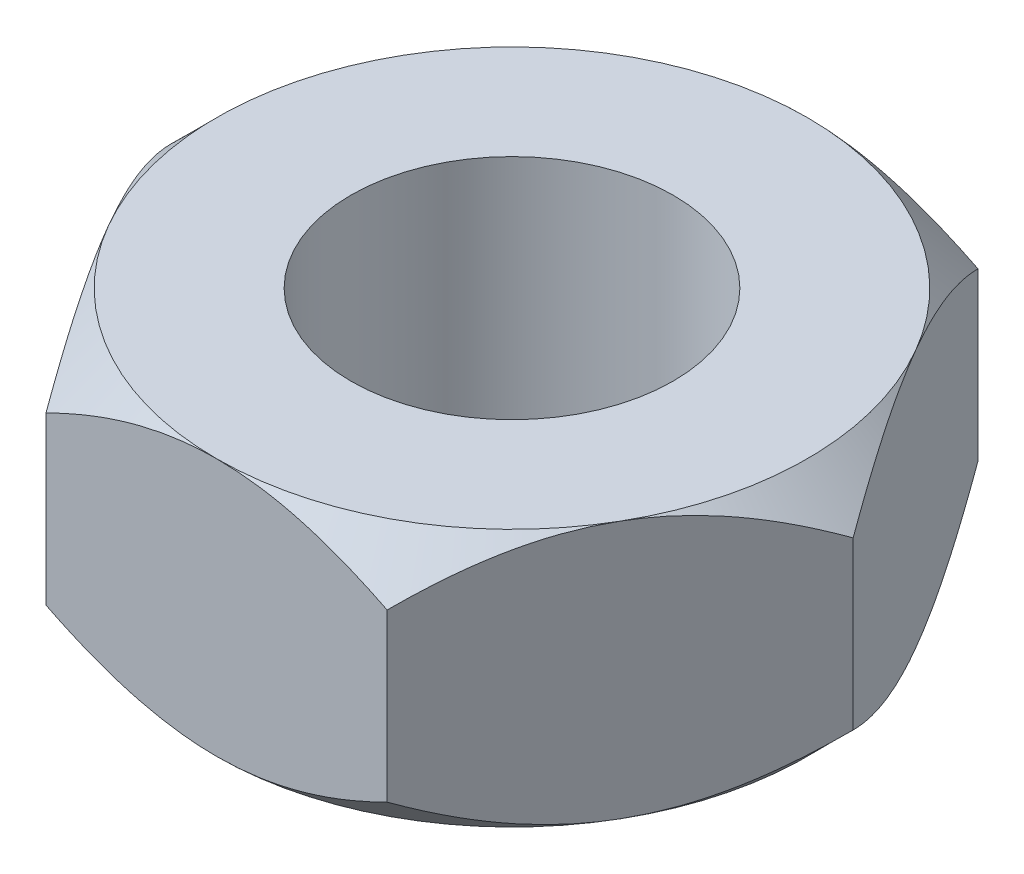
ISO-10303-21;
HEADER;
FILE_DESCRIPTION(('STEP AP214'),'2;1');
FILE_NAME('part.step','',(''),(''),'','','');
FILE_SCHEMA(('AUTOMOTIVE_DESIGN { 1 0 10303 214 1 1 1 1 }'));
ENDSEC;
DATA;
#1=APPLICATION_CONTEXT('core data for automotive mechanical design processes');
#2=APPLICATION_PROTOCOL_DEFINITION('international standard','automotive_design',2000,#1);
#3=PRODUCT_CONTEXT('',#1,'mechanical');
#4=PRODUCT('Part','Part','',(#3));
#5=PRODUCT_RELATED_PRODUCT_CATEGORY('part','',(#4));
#6=PRODUCT_DEFINITION_FORMATION('','',#4);
#7=PRODUCT_DEFINITION_CONTEXT('part definition',#1,'design');
#8=PRODUCT_DEFINITION('design','',#6,#7);
#9=PRODUCT_DEFINITION_SHAPE('','',#8);
#10=(LENGTH_UNIT() NAMED_UNIT(*) SI_UNIT(.MILLI.,.METRE.));
#11=(NAMED_UNIT(*) PLANE_ANGLE_UNIT() SI_UNIT($,.RADIAN.));
#12=(NAMED_UNIT(*) SI_UNIT($,.STERADIAN.) SOLID_ANGLE_UNIT());
#13=UNCERTAINTY_MEASURE_WITH_UNIT(LENGTH_MEASURE(1.E-05),#10,'distance_accuracy_value','');
#14=(GEOMETRIC_REPRESENTATION_CONTEXT(3) GLOBAL_UNCERTAINTY_ASSIGNED_CONTEXT((#13)) GLOBAL_UNIT_ASSIGNED_CONTEXT((#10,
#11,#12)) REPRESENTATION_CONTEXT('',''));
#15=CARTESIAN_POINT('',(0.,0.,0.));
#16=DIRECTION('',(0.,0.,1.));
#17=DIRECTION('',(1.,0.,0.));
#18=AXIS2_PLACEMENT_3D('',#15,#16,#17);
#19=CARTESIAN_POINT('',(4.76313972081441,2.4,-2.75));
#20=DIRECTION('',(0.,1.,0.));
#21=DIRECTION('',(0.,0.,1.));
#22=AXIS2_PLACEMENT_3D('',#19,#20,#21);
#23=PLANE('',#22);
#24=CARTESIAN_POINT('',(0.,2.4,0.));
#25=DIRECTION('',(0.,1.,0.));
#26=DIRECTION('',(0.,0.,1.));
#27=AXIS2_PLACEMENT_3D('',#24,#25,#26);
#28=CIRCLE('',#27,2.75);
#29=CARTESIAN_POINT('',(-2.38156986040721,2.4,1.375));
#30=VERTEX_POINT('',#29);
#31=CARTESIAN_POINT('',(0.,2.4,2.75));
#32=VERTEX_POINT('',#31);
#33=EDGE_CURVE('E146',#30,#32,#28,.T.);
#34=ORIENTED_EDGE('',*,*,#33,.T.);
#35=CARTESIAN_POINT('',(2.38156986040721,2.4,1.375));
#36=VERTEX_POINT('',#35);
#37=EDGE_CURVE('E271',#32,#36,#28,.T.);
#38=ORIENTED_EDGE('',*,*,#37,.T.);
#39=CARTESIAN_POINT('',(2.38156986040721,2.4,-1.375));
#40=VERTEX_POINT('',#39);
#41=EDGE_CURVE('E273',#36,#40,#28,.T.);
#42=ORIENTED_EDGE('',*,*,#41,.T.);
#43=CARTESIAN_POINT('',(0.,2.4,-2.75));
#44=VERTEX_POINT('',#43);
#45=EDGE_CURVE('E280',#40,#44,#28,.T.);
#46=ORIENTED_EDGE('',*,*,#45,.T.);
#47=CARTESIAN_POINT('',(-2.38156986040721,2.4,-1.375));
#48=VERTEX_POINT('',#47);
#49=EDGE_CURVE('E284',#44,#48,#28,.T.);
#50=ORIENTED_EDGE('',*,*,#49,.T.);
#51=EDGE_CURVE('E281',#48,#30,#28,.T.);
#52=ORIENTED_EDGE('',*,*,#51,.T.);
#53=EDGE_LOOP('',(#34,#38,#42,#46,#50,#52));
#54=FACE_BOUND('',#53,.T.);
#55=CARTESIAN_POINT('',(0.,2.4,0.));
#56=DIRECTION('',(0.,1.,0.));
#57=DIRECTION('',(0.,0.,1.));
#58=AXIS2_PLACEMENT_3D('',#55,#56,#57);
#59=CIRCLE('',#58,1.5);
#60=CARTESIAN_POINT('',(0.,2.4,1.5));
#61=VERTEX_POINT('',#60);
#62=EDGE_CURVE('E237',#61,#61,#59,.T.);
#63=ORIENTED_EDGE('',*,*,#62,.F.);
#64=EDGE_LOOP('',(#63));
#65=FACE_BOUND('',#64,.T.);
#66=ADVANCED_FACE('F32',(#54,#65),#23,.T.);
#67=CARTESIAN_POINT('',(4.76313972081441,0.,-2.75));
#68=DIRECTION('',(0.,1.,0.));
#69=DIRECTION('',(0.,0.,1.));
#70=AXIS2_PLACEMENT_3D('',#67,#68,#69);
#71=PLANE('',#70);
#72=CARTESIAN_POINT('',(0.,0.,0.));
#73=DIRECTION('',(0.,1.,0.));
#74=DIRECTION('',(0.,0.,1.));
#75=AXIS2_PLACEMENT_3D('',#72,#73,#74);
#76=CIRCLE('',#75,1.5);
#77=CARTESIAN_POINT('',(0.,0.,1.5));
#78=VERTEX_POINT('',#77);
#79=EDGE_CURVE('E240',#78,#78,#76,.F.);
#80=ORIENTED_EDGE('',*,*,#79,.F.);
#81=EDGE_LOOP('',(#80));
#82=FACE_BOUND('',#81,.T.);
#83=CARTESIAN_POINT('',(0.,0.,0.));
#84=DIRECTION('',(0.,1.,0.));
#85=DIRECTION('',(0.,0.,1.));
#86=AXIS2_PLACEMENT_3D('',#83,#84,#85);
#87=CIRCLE('',#86,2.75);
#88=CARTESIAN_POINT('',(0.,0.,2.75));
#89=VERTEX_POINT('',#88);
#90=CARTESIAN_POINT('',(2.38156986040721,0.,1.375));
#91=VERTEX_POINT('',#90);
#92=EDGE_CURVE('E139',#89,#91,#87,.T.);
#93=ORIENTED_EDGE('',*,*,#92,.F.);
#94=CARTESIAN_POINT('',(-2.38156986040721,0.,1.375));
#95=VERTEX_POINT('',#94);
#96=EDGE_CURVE('E148',#95,#89,#87,.T.);
#97=ORIENTED_EDGE('',*,*,#96,.F.);
#98=CARTESIAN_POINT('',(-2.38156986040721,0.,-1.375));
#99=VERTEX_POINT('',#98);
#100=EDGE_CURVE('E268',#99,#95,#87,.T.);
#101=ORIENTED_EDGE('',*,*,#100,.F.);
#102=CARTESIAN_POINT('',(0.,0.,-2.75));
#103=VERTEX_POINT('',#102);
#104=EDGE_CURVE('E264',#103,#99,#87,.T.);
#105=ORIENTED_EDGE('',*,*,#104,.F.);
#106=CARTESIAN_POINT('',(2.38156986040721,0.,-1.375));
#107=VERTEX_POINT('',#106);
#108=EDGE_CURVE('E152',#107,#103,#87,.T.);
#109=ORIENTED_EDGE('',*,*,#108,.F.);
#110=EDGE_CURVE('E127',#91,#107,#87,.T.);
#111=ORIENTED_EDGE('',*,*,#110,.F.);
#112=EDGE_LOOP('',(#93,#97,#101,#105,#109,#111));
#113=FACE_BOUND('',#112,.T.);
#114=ADVANCED_FACE('F149',(#82,#113),#71,.F.);
#115=CARTESIAN_POINT('',(0.,-0.00100000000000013,0.));
#116=DIRECTION('',(0.,1.,0.));
#117=DIRECTION('',(0.,0.,1.));
#118=AXIS2_PLACEMENT_3D('',#115,#116,#117);
#119=CYLINDRICAL_SURFACE('',#118,1.5);
#120=ORIENTED_EDGE('',*,*,#62,.T.);
#121=EDGE_LOOP('',(#120));
#122=FACE_BOUND('',#121,.T.);
#123=ORIENTED_EDGE('',*,*,#79,.T.);
#124=EDGE_LOOP('',(#123));
#125=FACE_BOUND('',#124,.T.);
#126=ADVANCED_FACE('F179',(#122,#125),#119,.F.);
#127=CARTESIAN_POINT('',(0.,0.,0.));
#128=DIRECTION('',(0.,1.,0.));
#129=DIRECTION('',(0.,0.,1.));
#130=AXIS2_PLACEMENT_3D('',#127,#128,#129);
#131=CONICAL_SURFACE('',#130,2.75,0.785398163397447);
#132=CARTESIAN_POINT('',(-3.31342670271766,1.55596057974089,2.75));
#133=CARTESIAN_POINT('',(-3.23337586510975,1.49437547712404,2.75));
#134=CARTESIAN_POINT('',(-3.15289369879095,1.43334222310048,2.75));
#135=CARTESIAN_POINT('',(-2.99089041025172,1.31263153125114,2.75));
#136=CARTESIAN_POINT('',(-2.90936904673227,1.25295441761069,2.75));
#137=CARTESIAN_POINT('',(-2.74451533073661,1.13478343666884,2.75));
#138=CARTESIAN_POINT('',(-2.66117385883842,1.07630224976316,2.75));
#139=CARTESIAN_POINT('',(-2.4931038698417,0.961375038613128,2.75));
#140=CARTESIAN_POINT('',(-2.40837544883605,0.904928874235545,2.75));
#141=CARTESIAN_POINT('',(-2.23186068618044,0.791026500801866,2.75));
#142=CARTESIAN_POINT('',(-2.1399680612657,0.733734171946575,2.75));
#143=CARTESIAN_POINT('',(-1.95405223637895,0.622722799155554,2.75));
#144=CARTESIAN_POINT('',(-1.86002931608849,0.569003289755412,2.75));
#145=CARTESIAN_POINT('',(-1.66978663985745,0.466254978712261,2.75));
#146=CARTESIAN_POINT('',(-1.57357402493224,0.417213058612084,2.75));
#147=CARTESIAN_POINT('',(-1.37842895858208,0.324927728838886,2.75));
#148=CARTESIAN_POINT('',(-1.27949781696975,0.28168158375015,2.75));
#149=CARTESIAN_POINT('',(-1.08860739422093,0.206459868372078,2.75));
#150=CARTESIAN_POINT('',(-0.9969232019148,0.173793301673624,2.75));
#151=CARTESIAN_POINT('',(-0.811218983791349,0.115798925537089,2.75));
#152=CARTESIAN_POINT('',(-0.717198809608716,0.0904715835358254,2.75));
#153=CARTESIAN_POINT('',(-0.529021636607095,0.048948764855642,2.75));
#154=CARTESIAN_POINT('',(-0.434901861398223,0.0325874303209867,2.75));
#155=CARTESIAN_POINT('',(-0.245493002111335,0.0093379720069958,2.75));
#156=CARTESIAN_POINT('',(-0.150204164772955,0.00244788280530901,2.75));
#157=CARTESIAN_POINT('',(0.0364036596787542,-0.00127223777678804,2.75));
#158=CARTESIAN_POINT('',(0.12771421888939,0.0014713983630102,2.75));
#159=CARTESIAN_POINT('',(0.309622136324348,0.0158887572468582,2.75));
#160=CARTESIAN_POINT('',(0.400219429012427,0.027563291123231,2.75));
#161=CARTESIAN_POINT('',(0.581583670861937,0.0593799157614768,2.75));
#162=CARTESIAN_POINT('',(0.672323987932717,0.0796715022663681,2.75));
#163=CARTESIAN_POINT('',(0.851796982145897,0.127599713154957,2.75));
#164=CARTESIAN_POINT('',(0.940529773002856,0.155235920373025,2.75));
#165=CARTESIAN_POINT('',(1.21360196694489,0.250846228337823,2.75));
#166=CARTESIAN_POINT('',(1.39423469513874,0.329440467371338,2.75));
#167=CARTESIAN_POINT('',(1.65860188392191,0.460546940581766,2.75));
#168=CARTESIAN_POINT('',(1.74578927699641,0.506553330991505,2.75));
#169=CARTESIAN_POINT('',(1.9181906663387,0.602134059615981,2.75));
#170=CARTESIAN_POINT('',(2.00340500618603,0.651707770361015,2.75));
#171=CARTESIAN_POINT('',(2.16792548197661,0.75118921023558,2.75));
#172=CARTESIAN_POINT('',(2.24731560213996,0.800959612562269,2.75));
#173=CARTESIAN_POINT('',(2.40473360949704,0.902620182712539,2.75));
#174=CARTESIAN_POINT('',(2.48276139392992,0.954510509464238,2.75));
#175=CARTESIAN_POINT('',(2.63700364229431,1.05960912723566,2.75));
#176=CARTESIAN_POINT('',(2.71322763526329,1.11280349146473,2.75));
#177=CARTESIAN_POINT('',(2.86462993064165,1.2206181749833,2.75));
#178=CARTESIAN_POINT('',(2.93980851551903,1.27523809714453,2.75));
#179=CARTESIAN_POINT('',(3.01454878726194,1.33044169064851,2.75));
#180=B_SPLINE_CURVE_WITH_KNOTS('',3,(#132,#133,#134,#135,#136,#137,#138,#139,#140,#141,#142,
#143,#144,#145,#146,#147,#148,#149,#150,#151,#152,#153,#154,#155,#156,#157,#158,#159,#160,#161,
#162,#163,#164,#165,#166,#167,#168,#169,#170,#171,#172,#173,#174,#175,#176,#177,#178,#179),
.UNSPECIFIED.,.F.,.F.,(4,2,2,2,2,2,2,2,2,2,2,2,2,2,2,2,2,2,2,2,2,2,2,4),(0.,0.303003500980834,
0.606078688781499,0.911492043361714,1.21688432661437,1.54168948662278,1.86645224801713,
2.19027563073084,2.5139456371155,2.80568346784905,3.09743987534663,3.38359946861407,
3.66969967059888,3.94330135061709,4.21692788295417,4.49550901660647,4.77407433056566,
5.36322151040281,5.65893957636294,5.9546057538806,6.23567458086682,6.51676451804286,
6.7955976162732,7.07435384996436),.UNSPECIFIED.);
#181=CARTESIAN_POINT('',(1.58771324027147,0.425426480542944,2.75));
#182=VERTEX_POINT('',#181);
#183=EDGE_CURVE('E142',#89,#182,#180,.T.);
#184=ORIENTED_EDGE('',*,*,#183,.F.);
#185=ORIENTED_EDGE('',*,*,#92,.T.);
#186=CARTESIAN_POINT('',(1.58759777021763,0.425541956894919,2.7502));
#187=CARTESIAN_POINT('',(1.64217521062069,0.371010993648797,2.65566910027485));
#188=CARTESIAN_POINT('',(1.69766525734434,0.319682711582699,2.55955752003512));
#189=CARTESIAN_POINT('',(1.81081556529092,0.225701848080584,2.36357543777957));
#190=CARTESIAN_POINT('',(1.8684865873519,0.183101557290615,2.26368629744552));
#191=CARTESIAN_POINT('',(1.98477744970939,0.110126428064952,2.06226461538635));
#192=CARTESIAN_POINT('',(2.04336767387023,0.0795681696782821,1.96078337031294));
#193=CARTESIAN_POINT('',(2.16183796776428,0.0324868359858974,1.75558680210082));
#194=CARTESIAN_POINT('',(2.22171441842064,0.0159286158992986,1.65187774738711));
#195=CARTESIAN_POINT('',(2.32490849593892,0.000988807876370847,1.47314036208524));
#196=CARTESIAN_POINT('',(2.3680928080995,-0.00122274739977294,1.39834293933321));
#197=CARTESIAN_POINT('',(2.45439083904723,0.00250321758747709,1.24887036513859));
#198=CARTESIAN_POINT('',(2.49750452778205,0.00844359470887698,1.17419526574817));
#199=CARTESIAN_POINT('',(2.58332480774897,0.0281353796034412,1.02555018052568));
#200=CARTESIAN_POINT('',(2.62603088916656,0.0418955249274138,0.951581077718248));
#201=CARTESIAN_POINT('',(2.71070455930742,0.0764715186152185,0.80492197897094));
#202=CARTESIAN_POINT('',(2.75267220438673,0.0972868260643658,0.732231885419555));
#203=CARTESIAN_POINT('',(2.8601670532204,0.159080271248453,0.546045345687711));
#204=CARTESIAN_POINT('',(2.92502780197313,0.204715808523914,0.433703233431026));
#205=CARTESIAN_POINT('',(3.02039991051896,0.281754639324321,0.268513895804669));
#206=CARTESIAN_POINT('',(3.05182928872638,0.308822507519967,0.214076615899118));
#207=CARTESIAN_POINT('',(3.11410588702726,0.365425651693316,0.10621038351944));
#208=CARTESIAN_POINT('',(3.14495345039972,0.394959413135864,0.0527808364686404));
#209=CARTESIAN_POINT('',(3.17554195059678,0.425541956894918,-0.000199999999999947));
#210=B_SPLINE_CURVE_WITH_KNOTS('',3,(#186,#187,#188,#189,#190,#191,#192,#193,#194,#195,#196,
#197,#198,#199,#200,#201,#202,#203,#204,#205,#206,#207,#208,#209),.UNSPECIFIED.,.F.,.F.,(4,2,2,
2,2,2,2,2,2,2,2,4),(0.,0.366307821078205,0.734749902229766,1.09734036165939,1.45901787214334,
1.71784182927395,1.97675651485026,2.23596107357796,2.49514576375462,2.90682558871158,
3.11210731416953,3.31726387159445),.UNSPECIFIED.);
#211=EDGE_CURVE('E134',#182,#91,#210,.T.);
#212=ORIENTED_EDGE('',*,*,#211,.F.);
#213=EDGE_LOOP('',(#184,#185,#212));
#214=FACE_BOUND('',#213,.T.);
#215=ADVANCED_FACE('F140',(#214),#131,.T.);
#216=ORIENTED_EDGE('',*,*,#110,.T.);
#217=CARTESIAN_POINT('',(3.17554195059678,0.425541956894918,0.000199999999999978));
#218=CARTESIAN_POINT('',(3.12096451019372,0.371010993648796,-0.094330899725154));
#219=CARTESIAN_POINT('',(3.06547446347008,0.319682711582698,-0.190442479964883));
#220=CARTESIAN_POINT('',(2.95232415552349,0.225701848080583,-0.38642456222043));
#221=CARTESIAN_POINT('',(2.89465313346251,0.183101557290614,-0.486313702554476));
#222=CARTESIAN_POINT('',(2.77836227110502,0.110126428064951,-0.687735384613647));
#223=CARTESIAN_POINT('',(2.71977204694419,0.0795681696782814,-0.789216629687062));
#224=CARTESIAN_POINT('',(2.60130175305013,0.032486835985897,-0.994413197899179));
#225=CARTESIAN_POINT('',(2.54142530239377,0.0159286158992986,-1.09812225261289));
#226=CARTESIAN_POINT('',(2.43823122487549,0.00098880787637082,-1.27685963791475));
#227=CARTESIAN_POINT('',(2.39504691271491,-0.0012227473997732,-1.35165706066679));
#228=CARTESIAN_POINT('',(2.30874888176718,0.0025032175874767,-1.50112963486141));
#229=CARTESIAN_POINT('',(2.26563519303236,0.00844359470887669,-1.57580473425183));
#230=CARTESIAN_POINT('',(2.17981491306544,0.0281353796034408,-1.72444981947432));
#231=CARTESIAN_POINT('',(2.13710883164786,0.0418955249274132,-1.79841892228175));
#232=CARTESIAN_POINT('',(2.05243516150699,0.0764715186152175,-1.94507802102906));
#233=CARTESIAN_POINT('',(2.01046751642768,0.0972868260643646,-2.01776811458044));
#234=CARTESIAN_POINT('',(1.90297266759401,0.159080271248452,-2.20395465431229));
#235=CARTESIAN_POINT('',(1.83811191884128,0.204715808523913,-2.31629676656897));
#236=CARTESIAN_POINT('',(1.74273981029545,0.281754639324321,-2.48148610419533));
#237=CARTESIAN_POINT('',(1.71131043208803,0.308822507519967,-2.53592338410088));
#238=CARTESIAN_POINT('',(1.64903383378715,0.365425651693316,-2.64378961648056));
#239=CARTESIAN_POINT('',(1.61818627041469,0.394959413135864,-2.69721916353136));
#240=CARTESIAN_POINT('',(1.58759777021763,0.425541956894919,-2.7502));
#241=B_SPLINE_CURVE_WITH_KNOTS('',3,(#217,#218,#219,#220,#221,#222,#223,#224,#225,#226,#227,
#228,#229,#230,#231,#232,#233,#234,#235,#236,#237,#238,#239,#240),.UNSPECIFIED.,.F.,.F.,(4,2,2,
2,2,2,2,2,2,2,2,4),(0.,0.366307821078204,0.734749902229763,1.09734036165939,1.45901787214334,
1.71784182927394,1.97675651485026,2.23596107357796,2.49514576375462,2.90682558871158,
3.11210731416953,3.31726387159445),.UNSPECIFIED.);
#242=CARTESIAN_POINT('',(3.17542648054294,0.425426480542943,0.));
#243=VERTEX_POINT('',#242);
#244=EDGE_CURVE('E130',#243,#107,#241,.T.);
#245=ORIENTED_EDGE('',*,*,#244,.F.);
#246=EDGE_CURVE('E123',#91,#243,#210,.T.);
#247=ORIENTED_EDGE('',*,*,#246,.F.);
#248=EDGE_LOOP('',(#216,#245,#247));
#249=FACE_BOUND('',#248,.T.);
#250=ADVANCED_FACE('F125',(#249),#131,.T.);
#251=ORIENTED_EDGE('',*,*,#108,.T.);
#252=CARTESIAN_POINT('',(-3.31342670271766,1.55596057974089,-2.75));
#253=CARTESIAN_POINT('',(-3.23337586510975,1.49437547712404,-2.75));
#254=CARTESIAN_POINT('',(-3.15289369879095,1.43334222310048,-2.75));
#255=CARTESIAN_POINT('',(-2.99089041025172,1.31263153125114,-2.75));
#256=CARTESIAN_POINT('',(-2.90936904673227,1.25295441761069,-2.75));
#257=CARTESIAN_POINT('',(-2.74451533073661,1.13478343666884,-2.75));
#258=CARTESIAN_POINT('',(-2.66117385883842,1.07630224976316,-2.75));
#259=CARTESIAN_POINT('',(-2.4931038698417,0.961375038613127,-2.75));
#260=CARTESIAN_POINT('',(-2.40837544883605,0.904928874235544,-2.75));
#261=CARTESIAN_POINT('',(-2.23186068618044,0.791026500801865,-2.75));
#262=CARTESIAN_POINT('',(-2.1399680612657,0.733734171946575,-2.75));
#263=CARTESIAN_POINT('',(-1.95405223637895,0.622722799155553,-2.75));
#264=CARTESIAN_POINT('',(-1.86002931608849,0.569003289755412,-2.75));
#265=CARTESIAN_POINT('',(-1.66978663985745,0.466254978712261,-2.75));
#266=CARTESIAN_POINT('',(-1.57357402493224,0.417213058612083,-2.75));
#267=CARTESIAN_POINT('',(-1.37842895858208,0.324927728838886,-2.75));
#268=CARTESIAN_POINT('',(-1.27949781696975,0.281681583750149,-2.75));
#269=CARTESIAN_POINT('',(-1.08860739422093,0.206459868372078,-2.75));
#270=CARTESIAN_POINT('',(-0.9969232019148,0.173793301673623,-2.75));
#271=CARTESIAN_POINT('',(-0.811218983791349,0.115798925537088,-2.75));
#272=CARTESIAN_POINT('',(-0.717198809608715,0.090471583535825,-2.75));
#273=CARTESIAN_POINT('',(-0.529021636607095,0.0489487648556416,-2.75));
#274=CARTESIAN_POINT('',(-0.434901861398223,0.0325874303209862,-2.75));
#275=CARTESIAN_POINT('',(-0.245493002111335,0.0093379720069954,-2.75));
#276=CARTESIAN_POINT('',(-0.150204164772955,0.00244788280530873,-2.75));
#277=CARTESIAN_POINT('',(0.0364036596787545,-0.00127223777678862,-2.75));
#278=CARTESIAN_POINT('',(0.127714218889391,0.00147139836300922,-2.75));
#279=CARTESIAN_POINT('',(0.309622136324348,0.0158887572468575,-2.75));
#280=CARTESIAN_POINT('',(0.400219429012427,0.0275632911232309,-2.75));
#281=CARTESIAN_POINT('',(0.581583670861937,0.0593799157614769,-2.75));
#282=CARTESIAN_POINT('',(0.672323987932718,0.0796715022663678,-2.75));
#283=CARTESIAN_POINT('',(0.851796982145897,0.127599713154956,-2.75));
#284=CARTESIAN_POINT('',(0.940529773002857,0.155235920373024,-2.75));
#285=CARTESIAN_POINT('',(1.21360196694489,0.250846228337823,-2.75));
#286=CARTESIAN_POINT('',(1.39423469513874,0.329440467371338,-2.75));
#287=CARTESIAN_POINT('',(1.65860188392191,0.460546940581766,-2.75));
#288=CARTESIAN_POINT('',(1.74578927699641,0.506553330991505,-2.75));
#289=CARTESIAN_POINT('',(1.9181906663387,0.60213405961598,-2.75));
#290=CARTESIAN_POINT('',(2.00340500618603,0.651707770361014,-2.75));
#291=CARTESIAN_POINT('',(2.16792548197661,0.751189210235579,-2.75));
#292=CARTESIAN_POINT('',(2.24731560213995,0.800959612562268,-2.75));
#293=CARTESIAN_POINT('',(2.40473360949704,0.902620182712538,-2.75));
#294=CARTESIAN_POINT('',(2.48276139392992,0.954510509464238,-2.75));
#295=CARTESIAN_POINT('',(2.63700364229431,1.05960912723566,-2.75));
#296=CARTESIAN_POINT('',(2.71322763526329,1.11280349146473,-2.75));
#297=CARTESIAN_POINT('',(2.86462993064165,1.2206181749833,-2.75));
#298=CARTESIAN_POINT('',(2.93980851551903,1.27523809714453,-2.75));
#299=CARTESIAN_POINT('',(3.01454878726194,1.33044169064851,-2.75));
#300=B_SPLINE_CURVE_WITH_KNOTS('',3,(#252,#253,#254,#255,#256,#257,#258,#259,#260,#261,#262,
#263,#264,#265,#266,#267,#268,#269,#270,#271,#272,#273,#274,#275,#276,#277,#278,#279,#280,#281,
#282,#283,#284,#285,#286,#287,#288,#289,#290,#291,#292,#293,#294,#295,#296,#297,#298,#299),
.UNSPECIFIED.,.F.,.F.,(4,2,2,2,2,2,2,2,2,2,2,2,2,2,2,2,2,2,2,2,2,2,2,4),(0.,0.303003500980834,
0.606078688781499,0.911492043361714,1.21688432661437,1.54168948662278,1.86645224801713,
2.19027563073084,2.5139456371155,2.80568346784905,3.09743987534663,3.38359946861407,
3.66969967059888,3.94330135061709,4.21692788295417,4.49550901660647,4.77407433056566,
5.36322151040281,5.65893957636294,5.9546057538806,6.23567458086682,6.51676451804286,
6.7955976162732,7.07435384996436),.UNSPECIFIED.);
#301=CARTESIAN_POINT('',(1.58771324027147,0.425426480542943,-2.75));
#302=VERTEX_POINT('',#301);
#303=EDGE_CURVE('E212',#302,#103,#300,.F.);
#304=ORIENTED_EDGE('',*,*,#303,.F.);
#305=EDGE_CURVE('E166',#107,#302,#241,.T.);
#306=ORIENTED_EDGE('',*,*,#305,.F.);
#307=EDGE_LOOP('',(#251,#304,#306));
#308=FACE_BOUND('',#307,.T.);
#309=ADVANCED_FACE('F263',(#308),#131,.T.);
#310=ORIENTED_EDGE('',*,*,#104,.T.);
#311=CARTESIAN_POINT('',(-1.58759777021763,0.425541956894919,-2.7502));
#312=CARTESIAN_POINT('',(-1.64217521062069,0.371010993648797,-2.65566910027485));
#313=CARTESIAN_POINT('',(-1.69766525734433,0.319682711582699,-2.55955752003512));
#314=CARTESIAN_POINT('',(-1.81081556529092,0.225701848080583,-2.36357543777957));
#315=CARTESIAN_POINT('',(-1.8684865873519,0.183101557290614,-2.26368629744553));
#316=CARTESIAN_POINT('',(-1.98477744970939,0.110126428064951,-2.06226461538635));
#317=CARTESIAN_POINT('',(-2.04336767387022,0.0795681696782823,-1.96078337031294));
#318=CARTESIAN_POINT('',(-2.16183796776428,0.0324868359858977,-1.75558680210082));
#319=CARTESIAN_POINT('',(-2.22171441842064,0.0159286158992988,-1.65187774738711));
#320=CARTESIAN_POINT('',(-2.32490849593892,0.000988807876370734,-1.47314036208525));
#321=CARTESIAN_POINT('',(-2.3680928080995,-0.00122274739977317,-1.39834293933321));
#322=CARTESIAN_POINT('',(-2.45439083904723,0.00250321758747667,-1.24887036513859));
#323=CARTESIAN_POINT('',(-2.49750452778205,0.00844359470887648,-1.17419526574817));
#324=CARTESIAN_POINT('',(-2.58332480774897,0.0281353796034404,-1.02555018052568));
#325=CARTESIAN_POINT('',(-2.62603088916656,0.0418955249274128,-0.951581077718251));
#326=CARTESIAN_POINT('',(-2.71070455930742,0.0764715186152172,-0.804921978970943));
#327=CARTESIAN_POINT('',(-2.75267220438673,0.0972868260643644,-0.732231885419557));
#328=CARTESIAN_POINT('',(-2.8601670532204,0.159080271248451,-0.546045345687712));
#329=CARTESIAN_POINT('',(-2.92502780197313,0.204715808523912,-0.433703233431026));
#330=CARTESIAN_POINT('',(-3.02039991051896,0.28175463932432,-0.268513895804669));
#331=CARTESIAN_POINT('',(-3.05182928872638,0.308822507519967,-0.214076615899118));
#332=CARTESIAN_POINT('',(-3.11410588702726,0.365425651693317,-0.10621038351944));
#333=CARTESIAN_POINT('',(-3.14495345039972,0.394959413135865,-0.0527808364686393));
#334=CARTESIAN_POINT('',(-3.17554195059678,0.425541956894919,0.000200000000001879));
#335=B_SPLINE_CURVE_WITH_KNOTS('',3,(#311,#312,#313,#314,#315,#316,#317,#318,#319,#320,#321,
#322,#323,#324,#325,#326,#327,#328,#329,#330,#331,#332,#333,#334),.UNSPECIFIED.,.F.,.F.,(4,2,2,
2,2,2,2,2,2,2,2,4),(0.,0.366307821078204,0.734749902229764,1.09734036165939,1.45901787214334,
1.71784182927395,1.97675651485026,2.23596107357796,2.49514576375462,2.90682558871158,
3.11210731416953,3.31726387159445),.UNSPECIFIED.);
#336=CARTESIAN_POINT('',(-1.58771324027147,0.425426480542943,-2.75));
#337=VERTEX_POINT('',#336);
#338=EDGE_CURVE('E213',#337,#99,#335,.T.);
#339=ORIENTED_EDGE('',*,*,#338,.F.);
#340=EDGE_CURVE('E206',#103,#337,#300,.F.);
#341=ORIENTED_EDGE('',*,*,#340,.F.);
#342=EDGE_LOOP('',(#310,#339,#341));
#343=FACE_BOUND('',#342,.T.);
#344=ADVANCED_FACE('F345',(#343),#131,.T.);
#345=ORIENTED_EDGE('',*,*,#100,.T.);
#346=CARTESIAN_POINT('',(-3.17554195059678,0.425541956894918,-0.000199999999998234));
#347=CARTESIAN_POINT('',(-3.12096451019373,0.371010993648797,0.0943308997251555));
#348=CARTESIAN_POINT('',(-3.06547446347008,0.319682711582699,0.190442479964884));
#349=CARTESIAN_POINT('',(-2.95232415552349,0.225701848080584,0.386424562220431));
#350=CARTESIAN_POINT('',(-2.89465313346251,0.183101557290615,0.486313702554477));
#351=CARTESIAN_POINT('',(-2.77836227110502,0.110126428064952,0.687735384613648));
#352=CARTESIAN_POINT('',(-2.71977204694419,0.079568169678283,0.789216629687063));
#353=CARTESIAN_POINT('',(-2.60130175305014,0.0324868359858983,0.994413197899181));
#354=CARTESIAN_POINT('',(-2.54142530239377,0.0159286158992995,1.09812225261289));
#355=CARTESIAN_POINT('',(-2.43823122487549,0.00098880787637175,1.27685963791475));
#356=CARTESIAN_POINT('',(-2.39504691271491,-0.00122274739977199,1.35165706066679));
#357=CARTESIAN_POINT('',(-2.30874888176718,0.00250321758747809,1.50112963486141));
#358=CARTESIAN_POINT('',(-2.26563519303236,0.00844359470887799,1.57580473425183));
#359=CARTESIAN_POINT('',(-2.17981491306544,0.0281353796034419,1.72444981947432));
#360=CARTESIAN_POINT('',(-2.13710883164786,0.0418955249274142,1.79841892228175));
#361=CARTESIAN_POINT('',(-2.05243516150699,0.0764715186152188,1.94507802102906));
#362=CARTESIAN_POINT('',(-2.01046751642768,0.0972868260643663,2.01776811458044));
#363=CARTESIAN_POINT('',(-1.90297266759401,0.159080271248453,2.20395465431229));
#364=CARTESIAN_POINT('',(-1.83811191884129,0.204715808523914,2.31629676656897));
#365=CARTESIAN_POINT('',(-1.74273981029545,0.281754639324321,2.48148610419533));
#366=CARTESIAN_POINT('',(-1.71131043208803,0.308822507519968,2.53592338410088));
#367=CARTESIAN_POINT('',(-1.64903383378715,0.365425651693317,2.64378961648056));
#368=CARTESIAN_POINT('',(-1.61818627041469,0.394959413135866,2.69721916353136));
#369=CARTESIAN_POINT('',(-1.58759777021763,0.425541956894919,2.7502));
#370=B_SPLINE_CURVE_WITH_KNOTS('',3,(#346,#347,#348,#349,#350,#351,#352,#353,#354,#355,#356,
#357,#358,#359,#360,#361,#362,#363,#364,#365,#366,#367,#368,#369),.UNSPECIFIED.,.F.,.F.,(4,2,2,
2,2,2,2,2,2,2,2,4),(0.,0.366307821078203,0.734749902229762,1.09734036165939,1.45901787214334,
1.71784182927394,1.97675651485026,2.23596107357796,2.49514576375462,2.90682558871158,
3.11210731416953,3.31726387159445),.UNSPECIFIED.);
#371=CARTESIAN_POINT('',(-3.17542648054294,0.425426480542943,0.));
#372=VERTEX_POINT('',#371);
#373=EDGE_CURVE('E343',#372,#95,#370,.T.);
#374=ORIENTED_EDGE('',*,*,#373,.F.);
#375=EDGE_CURVE('E201',#99,#372,#335,.T.);
#376=ORIENTED_EDGE('',*,*,#375,.F.);
#377=EDGE_LOOP('',(#345,#374,#376));
#378=FACE_BOUND('',#377,.T.);
#379=ADVANCED_FACE('F347',(#378),#131,.T.);
#380=ORIENTED_EDGE('',*,*,#96,.T.);
#381=CARTESIAN_POINT('',(-1.58771324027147,0.425426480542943,2.75));
#382=VERTEX_POINT('',#381);
#383=EDGE_CURVE('E279',#382,#89,#180,.T.);
#384=ORIENTED_EDGE('',*,*,#383,.F.);
#385=EDGE_CURVE('E194',#95,#382,#370,.T.);
#386=ORIENTED_EDGE('',*,*,#385,.F.);
#387=EDGE_LOOP('',(#380,#384,#386));
#388=FACE_BOUND('',#387,.T.);
#389=ADVANCED_FACE('F180',(#388),#131,.T.);
#390=CARTESIAN_POINT('',(0.,1.97457351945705,0.));
#391=DIRECTION('',(0.,-1.,0.));
#392=DIRECTION('',(0.,0.,-1.));
#393=AXIS2_PLACEMENT_3D('',#390,#391,#392);
#394=CONICAL_SURFACE('',#393,3.17542648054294,0.785398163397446);
#395=ORIENTED_EDGE('',*,*,#37,.F.);
#396=CARTESIAN_POINT('',(-3.31342670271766,0.84403942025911,2.75));
#397=CARTESIAN_POINT('',(-3.23337586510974,0.90562452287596,2.75));
#398=CARTESIAN_POINT('',(-3.15289369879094,0.966657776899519,2.75));
#399=CARTESIAN_POINT('',(-2.99089041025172,1.08736846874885,2.75));
#400=CARTESIAN_POINT('',(-2.90936904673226,1.14704558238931,2.75));
#401=CARTESIAN_POINT('',(-2.7445153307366,1.26521656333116,2.75));
#402=CARTESIAN_POINT('',(-2.66117385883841,1.32369775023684,2.75));
#403=CARTESIAN_POINT('',(-2.4931038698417,1.43862496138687,2.75));
#404=CARTESIAN_POINT('',(-2.40837544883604,1.49507112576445,2.75));
#405=CARTESIAN_POINT('',(-2.23186068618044,1.60897349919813,2.75));
#406=CARTESIAN_POINT('',(-2.1399680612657,1.66626582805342,2.75));
#407=CARTESIAN_POINT('',(-1.95405223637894,1.77727720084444,2.75));
#408=CARTESIAN_POINT('',(-1.86002931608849,1.83099671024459,2.75));
#409=CARTESIAN_POINT('',(-1.66978663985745,1.93374502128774,2.75));
#410=CARTESIAN_POINT('',(-1.57357402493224,1.98278694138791,2.75));
#411=CARTESIAN_POINT('',(-1.37842895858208,2.07507227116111,2.75));
#412=CARTESIAN_POINT('',(-1.27949781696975,2.11831841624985,2.75));
#413=CARTESIAN_POINT('',(-1.08860739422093,2.19354013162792,2.75));
#414=CARTESIAN_POINT('',(-0.9969232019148,2.22620669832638,2.75));
#415=CARTESIAN_POINT('',(-0.81121898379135,2.28420107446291,2.75));
#416=CARTESIAN_POINT('',(-0.717198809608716,2.30952841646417,2.75));
#417=CARTESIAN_POINT('',(-0.529021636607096,2.35105123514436,2.75));
#418=CARTESIAN_POINT('',(-0.434901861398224,2.36741256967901,2.75));
#419=CARTESIAN_POINT('',(-0.245493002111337,2.390662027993,2.75));
#420=CARTESIAN_POINT('',(-0.150204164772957,2.39755211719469,2.75));
#421=CARTESIAN_POINT('',(0.0364036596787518,2.40127223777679,2.75));
#422=CARTESIAN_POINT('',(0.127714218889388,2.39852860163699,2.75));
#423=CARTESIAN_POINT('',(0.309622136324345,2.38411124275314,2.75));
#424=CARTESIAN_POINT('',(0.400219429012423,2.37243670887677,2.75));
#425=CARTESIAN_POINT('',(0.581583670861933,2.34062008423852,2.75));
#426=CARTESIAN_POINT('',(0.672323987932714,2.32032849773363,2.75));
#427=CARTESIAN_POINT('',(0.851796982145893,2.27240028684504,2.75));
#428=CARTESIAN_POINT('',(0.940529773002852,2.24476407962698,2.75));
#429=CARTESIAN_POINT('',(1.21360196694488,2.14915377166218,2.75));
#430=CARTESIAN_POINT('',(1.39423469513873,2.07055953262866,2.75));
#431=CARTESIAN_POINT('',(1.6586018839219,1.93945305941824,2.75));
#432=CARTESIAN_POINT('',(1.7457892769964,1.8934466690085,2.75));
#433=CARTESIAN_POINT('',(1.91819066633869,1.79786594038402,2.75));
#434=CARTESIAN_POINT('',(2.00340500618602,1.74829222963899,2.75));
#435=CARTESIAN_POINT('',(2.16792548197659,1.64881078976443,2.75));
#436=CARTESIAN_POINT('',(2.24731560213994,1.59904038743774,2.75));
#437=CARTESIAN_POINT('',(2.40473360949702,1.49737981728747,2.75));
#438=CARTESIAN_POINT('',(2.48276139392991,1.44548949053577,2.75));
#439=CARTESIAN_POINT('',(2.63700364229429,1.34039087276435,2.75));
#440=CARTESIAN_POINT('',(2.71322763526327,1.28719650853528,2.75));
#441=CARTESIAN_POINT('',(2.86462993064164,1.17938182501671,2.75));
#442=CARTESIAN_POINT('',(2.93980851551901,1.12476190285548,2.75));
#443=CARTESIAN_POINT('',(3.01454878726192,1.0695583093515,2.75));
#444=B_SPLINE_CURVE_WITH_KNOTS('',3,(#396,#397,#398,#399,#400,#401,#402,#403,#404,#405,#406,
#407,#408,#409,#410,#411,#412,#413,#414,#415,#416,#417,#418,#419,#420,#421,#422,#423,#424,#425,
#426,#427,#428,#429,#430,#431,#432,#433,#434,#435,#436,#437,#438,#439,#440,#441,#442,#443),
.UNSPECIFIED.,.F.,.F.,(4,2,2,2,2,2,2,2,2,2,2,2,2,2,2,2,2,2,2,2,2,2,2,4),(0.,0.303003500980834,
0.606078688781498,0.911492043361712,1.21688432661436,1.54168948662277,1.86645224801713,
2.19027563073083,2.51394563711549,2.80568346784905,3.09743987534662,3.38359946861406,
3.66969967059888,3.94330135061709,4.21692788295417,4.49550901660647,4.77407433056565,
5.36322151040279,5.65893957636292,5.95460575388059,6.2356745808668,6.51676451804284,
6.79559761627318,7.07435384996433),.UNSPECIFIED.);
#445=CARTESIAN_POINT('',(1.58771324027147,1.97457351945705,2.75));
#446=VERTEX_POINT('',#445);
#447=EDGE_CURVE('E159',#446,#32,#444,.F.);
#448=ORIENTED_EDGE('',*,*,#447,.F.);
#449=CARTESIAN_POINT('',(3.17554195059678,1.97445804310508,-0.000200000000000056));
#450=CARTESIAN_POINT('',(3.12096451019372,2.0289890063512,0.0943308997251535));
#451=CARTESIAN_POINT('',(3.06547446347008,2.0803172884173,0.190442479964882));
#452=CARTESIAN_POINT('',(2.95232415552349,2.17429815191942,0.386424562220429));
#453=CARTESIAN_POINT('',(2.89465313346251,2.21689844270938,0.486313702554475));
#454=CARTESIAN_POINT('',(2.77836227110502,2.28987357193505,0.687735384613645));
#455=CARTESIAN_POINT('',(2.71977204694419,2.32043183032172,0.789216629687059));
#456=CARTESIAN_POINT('',(2.60130175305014,2.3675131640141,0.994413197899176));
#457=CARTESIAN_POINT('',(2.54142530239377,2.3840713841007,1.09812225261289));
#458=CARTESIAN_POINT('',(2.43823122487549,2.39901119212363,1.27685963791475));
#459=CARTESIAN_POINT('',(2.39504691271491,2.40122274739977,1.35165706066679));
#460=CARTESIAN_POINT('',(2.30874888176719,2.39749678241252,1.50112963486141));
#461=CARTESIAN_POINT('',(2.26563519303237,2.39155640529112,1.57580473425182));
#462=CARTESIAN_POINT('',(2.17981491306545,2.37186462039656,1.72444981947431));
#463=CARTESIAN_POINT('',(2.13710883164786,2.35810447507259,1.79841892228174));
#464=CARTESIAN_POINT('',(2.05243516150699,2.32352848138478,1.94507802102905));
#465=CARTESIAN_POINT('',(2.01046751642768,2.30271317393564,2.01776811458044));
#466=CARTESIAN_POINT('',(1.90297266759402,2.24091972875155,2.20395465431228));
#467=CARTESIAN_POINT('',(1.83811191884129,2.19528419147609,2.31629676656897));
#468=CARTESIAN_POINT('',(1.74273981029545,2.11824536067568,2.48148610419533));
#469=CARTESIAN_POINT('',(1.71131043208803,2.09117749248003,2.53592338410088));
#470=CARTESIAN_POINT('',(1.64903383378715,2.03457434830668,2.64378961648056));
#471=CARTESIAN_POINT('',(1.61818627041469,2.00504058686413,2.69721916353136));
#472=CARTESIAN_POINT('',(1.58759777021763,1.97445804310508,2.7502));
#473=B_SPLINE_CURVE_WITH_KNOTS('',3,(#449,#450,#451,#452,#453,#454,#455,#456,#457,#458,#459,
#460,#461,#462,#463,#464,#465,#466,#467,#468,#469,#470,#471,#472),.UNSPECIFIED.,.F.,.F.,(4,2,2,
2,2,2,2,2,2,2,2,4),(0.,0.366307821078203,0.734749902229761,1.09734036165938,1.45901787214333,
1.71784182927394,1.97675651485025,2.23596107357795,2.49514576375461,2.90682558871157,
3.11210731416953,3.31726387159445),.UNSPECIFIED.);
#474=EDGE_CURVE('E302',#36,#446,#473,.T.);
#475=ORIENTED_EDGE('',*,*,#474,.F.);
#476=EDGE_LOOP('',(#395,#448,#475));
#477=FACE_BOUND('',#476,.T.);
#478=ADVANCED_FACE('F311',(#477),#394,.T.);
#479=ORIENTED_EDGE('',*,*,#41,.F.);
#480=CARTESIAN_POINT('',(3.17542648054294,1.97457351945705,0.));
#481=VERTEX_POINT('',#480);
#482=EDGE_CURVE('E299',#481,#36,#473,.T.);
#483=ORIENTED_EDGE('',*,*,#482,.F.);
#484=CARTESIAN_POINT('',(1.58759777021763,1.97445804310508,-2.7502));
#485=CARTESIAN_POINT('',(1.64217521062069,2.0289890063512,-2.65566910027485));
#486=CARTESIAN_POINT('',(1.69766525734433,2.0803172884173,-2.55955752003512));
#487=CARTESIAN_POINT('',(1.81081556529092,2.17429815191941,-2.36357543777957));
#488=CARTESIAN_POINT('',(1.8684865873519,2.21689844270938,-2.26368629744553));
#489=CARTESIAN_POINT('',(1.98477744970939,2.28987357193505,-2.06226461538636));
#490=CARTESIAN_POINT('',(2.04336767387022,2.32043183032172,-1.96078337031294));
#491=CARTESIAN_POINT('',(2.16183796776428,2.3675131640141,-1.75558680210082));
#492=CARTESIAN_POINT('',(2.22171441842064,2.3840713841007,-1.65187774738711));
#493=CARTESIAN_POINT('',(2.32490849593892,2.39901119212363,-1.47314036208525));
#494=CARTESIAN_POINT('',(2.3680928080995,2.40122274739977,-1.39834293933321));
#495=CARTESIAN_POINT('',(2.45439083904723,2.39749678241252,-1.24887036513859));
#496=CARTESIAN_POINT('',(2.49750452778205,2.39155640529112,-1.17419526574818));
#497=CARTESIAN_POINT('',(2.58332480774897,2.37186462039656,-1.02555018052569));
#498=CARTESIAN_POINT('',(2.62603088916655,2.35810447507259,-0.951581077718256));
#499=CARTESIAN_POINT('',(2.71070455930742,2.32352848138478,-0.804921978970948));
#500=CARTESIAN_POINT('',(2.75267220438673,2.30271317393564,-0.732231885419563));
#501=CARTESIAN_POINT('',(2.8601670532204,2.24091972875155,-0.546045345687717));
#502=CARTESIAN_POINT('',(2.92502780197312,2.19528419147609,-0.433703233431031));
#503=CARTESIAN_POINT('',(3.02039991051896,2.11824536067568,-0.268513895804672));
#504=CARTESIAN_POINT('',(3.05182928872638,2.09117749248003,-0.214076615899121));
#505=CARTESIAN_POINT('',(3.11410588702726,2.03457434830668,-0.106210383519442));
#506=CARTESIAN_POINT('',(3.14495345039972,2.00504058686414,-0.052780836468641));
#507=CARTESIAN_POINT('',(3.17554195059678,1.97445804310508,0.000200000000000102));
#508=B_SPLINE_CURVE_WITH_KNOTS('',3,(#484,#485,#486,#487,#488,#489,#490,#491,#492,#493,#494,
#495,#496,#497,#498,#499,#500,#501,#502,#503,#504,#505,#506,#507),.UNSPECIFIED.,.F.,.F.,(4,2,2,
2,2,2,2,2,2,2,2,4),(0.,0.366307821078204,0.734749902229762,1.09734036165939,1.45901787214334,
1.71784182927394,1.97675651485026,2.23596107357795,2.49514576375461,2.90682558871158,
3.11210731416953,3.31726387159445),.UNSPECIFIED.);
#509=EDGE_CURVE('E232',#40,#481,#508,.T.);
#510=ORIENTED_EDGE('',*,*,#509,.F.);
#511=EDGE_LOOP('',(#479,#483,#510));
#512=FACE_BOUND('',#511,.T.);
#513=ADVANCED_FACE('F313',(#512),#394,.T.);
#514=ORIENTED_EDGE('',*,*,#45,.F.);
#515=CARTESIAN_POINT('',(1.58771324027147,1.97457351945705,-2.75));
#516=VERTEX_POINT('',#515);
#517=EDGE_CURVE('E261',#516,#40,#508,.T.);
#518=ORIENTED_EDGE('',*,*,#517,.F.);
#519=CARTESIAN_POINT('',(-3.31342670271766,0.84403942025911,-2.75));
#520=CARTESIAN_POINT('',(-3.23337586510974,0.90562452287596,-2.75));
#521=CARTESIAN_POINT('',(-3.15289369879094,0.966657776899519,-2.75));
#522=CARTESIAN_POINT('',(-2.99089041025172,1.08736846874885,-2.75));
#523=CARTESIAN_POINT('',(-2.90936904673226,1.14704558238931,-2.75));
#524=CARTESIAN_POINT('',(-2.7445153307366,1.26521656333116,-2.75));
#525=CARTESIAN_POINT('',(-2.66117385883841,1.32369775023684,-2.75));
#526=CARTESIAN_POINT('',(-2.4931038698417,1.43862496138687,-2.75));
#527=CARTESIAN_POINT('',(-2.40837544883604,1.49507112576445,-2.75));
#528=CARTESIAN_POINT('',(-2.23186068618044,1.60897349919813,-2.75));
#529=CARTESIAN_POINT('',(-2.1399680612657,1.66626582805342,-2.75));
#530=CARTESIAN_POINT('',(-1.95405223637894,1.77727720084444,-2.75));
#531=CARTESIAN_POINT('',(-1.86002931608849,1.83099671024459,-2.75));
#532=CARTESIAN_POINT('',(-1.66978663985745,1.93374502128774,-2.75));
#533=CARTESIAN_POINT('',(-1.57357402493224,1.98278694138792,-2.75));
#534=CARTESIAN_POINT('',(-1.37842895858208,2.07507227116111,-2.75));
#535=CARTESIAN_POINT('',(-1.27949781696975,2.11831841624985,-2.75));
#536=CARTESIAN_POINT('',(-1.08860739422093,2.19354013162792,-2.75));
#537=CARTESIAN_POINT('',(-0.996923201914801,2.22620669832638,-2.75));
#538=CARTESIAN_POINT('',(-0.81121898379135,2.28420107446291,-2.75));
#539=CARTESIAN_POINT('',(-0.717198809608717,2.30952841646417,-2.75));
#540=CARTESIAN_POINT('',(-0.529021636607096,2.35105123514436,-2.75));
#541=CARTESIAN_POINT('',(-0.434901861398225,2.36741256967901,-2.75));
#542=CARTESIAN_POINT('',(-0.245493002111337,2.390662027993,-2.75));
#543=CARTESIAN_POINT('',(-0.150204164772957,2.39755211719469,-2.75));
#544=CARTESIAN_POINT('',(0.0364036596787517,2.40127223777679,-2.75));
#545=CARTESIAN_POINT('',(0.127714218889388,2.39852860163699,-2.75));
#546=CARTESIAN_POINT('',(0.309622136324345,2.38411124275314,-2.75));
#547=CARTESIAN_POINT('',(0.400219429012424,2.37243670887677,-2.75));
#548=CARTESIAN_POINT('',(0.581583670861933,2.34062008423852,-2.75));
#549=CARTESIAN_POINT('',(0.672323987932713,2.32032849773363,-2.75));
#550=CARTESIAN_POINT('',(0.851796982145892,2.27240028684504,-2.75));
#551=CARTESIAN_POINT('',(0.940529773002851,2.24476407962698,-2.75));
#552=CARTESIAN_POINT('',(1.21360196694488,2.14915377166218,-2.75));
#553=CARTESIAN_POINT('',(1.39423469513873,2.07055953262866,-2.75));
#554=CARTESIAN_POINT('',(1.6586018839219,1.93945305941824,-2.75));
#555=CARTESIAN_POINT('',(1.7457892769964,1.8934466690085,-2.75));
#556=CARTESIAN_POINT('',(1.91819066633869,1.79786594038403,-2.75));
#557=CARTESIAN_POINT('',(2.00340500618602,1.74829222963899,-2.75));
#558=CARTESIAN_POINT('',(2.16792548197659,1.64881078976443,-2.75));
#559=CARTESIAN_POINT('',(2.24731560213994,1.59904038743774,-2.75));
#560=CARTESIAN_POINT('',(2.40473360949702,1.49737981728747,-2.75));
#561=CARTESIAN_POINT('',(2.4827613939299,1.44548949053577,-2.75));
#562=CARTESIAN_POINT('',(2.63700364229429,1.34039087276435,-2.75));
#563=CARTESIAN_POINT('',(2.71322763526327,1.28719650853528,-2.75));
#564=CARTESIAN_POINT('',(2.86462993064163,1.17938182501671,-2.75));
#565=CARTESIAN_POINT('',(2.93980851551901,1.12476190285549,-2.75));
#566=CARTESIAN_POINT('',(3.01454878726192,1.0695583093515,-2.75));
#567=B_SPLINE_CURVE_WITH_KNOTS('',3,(#519,#520,#521,#522,#523,#524,#525,#526,#527,#528,#529,
#530,#531,#532,#533,#534,#535,#536,#537,#538,#539,#540,#541,#542,#543,#544,#545,#546,#547,#548,
#549,#550,#551,#552,#553,#554,#555,#556,#557,#558,#559,#560,#561,#562,#563,#564,#565,#566),
.UNSPECIFIED.,.F.,.F.,(4,2,2,2,2,2,2,2,2,2,2,2,2,2,2,2,2,2,2,2,2,2,2,4),(0.,0.303003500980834,
0.606078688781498,0.911492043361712,1.21688432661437,1.54168948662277,1.86645224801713,
2.19027563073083,2.51394563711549,2.80568346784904,3.09743987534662,3.38359946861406,
3.66969967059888,3.94330135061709,4.21692788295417,4.49550901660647,4.77407433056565,
5.36322151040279,5.65893957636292,5.95460575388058,6.2356745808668,6.51676451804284,
6.79559761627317,7.07435384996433),.UNSPECIFIED.);
#568=EDGE_CURVE('E224',#44,#516,#567,.T.);
#569=ORIENTED_EDGE('',*,*,#568,.F.);
#570=EDGE_LOOP('',(#514,#518,#569));
#571=FACE_BOUND('',#570,.T.);
#572=ADVANCED_FACE('F315',(#571),#394,.T.);
#573=CARTESIAN_POINT('',(-3.17554195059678,1.97445804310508,0.0002000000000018));
#574=CARTESIAN_POINT('',(-3.12096451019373,2.0289890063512,-0.0943308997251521));
#575=CARTESIAN_POINT('',(-3.06547446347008,2.0803172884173,-0.190442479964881));
#576=CARTESIAN_POINT('',(-2.95232415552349,2.17429815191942,-0.386424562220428));
#577=CARTESIAN_POINT('',(-2.89465313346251,2.21689844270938,-0.486313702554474));
#578=CARTESIAN_POINT('',(-2.77836227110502,2.28987357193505,-0.687735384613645));
#579=CARTESIAN_POINT('',(-2.71977204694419,2.32043183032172,-0.789216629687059));
#580=CARTESIAN_POINT('',(-2.60130175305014,2.3675131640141,-0.994413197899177));
#581=CARTESIAN_POINT('',(-2.54142530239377,2.3840713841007,-1.09812225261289));
#582=CARTESIAN_POINT('',(-2.43823122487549,2.39901119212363,-1.27685963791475));
#583=CARTESIAN_POINT('',(-2.39504691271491,2.40122274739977,-1.35165706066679));
#584=CARTESIAN_POINT('',(-2.30874888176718,2.39749678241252,-1.50112963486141));
#585=CARTESIAN_POINT('',(-2.26563519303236,2.39155640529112,-1.57580473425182));
#586=CARTESIAN_POINT('',(-2.17981491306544,2.37186462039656,-1.72444981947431));
#587=CARTESIAN_POINT('',(-2.13710883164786,2.35810447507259,-1.79841892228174));
#588=CARTESIAN_POINT('',(-2.05243516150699,2.32352848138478,-1.94507802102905));
#589=CARTESIAN_POINT('',(-2.01046751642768,2.30271317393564,-2.01776811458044));
#590=CARTESIAN_POINT('',(-1.90297266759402,2.24091972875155,-2.20395465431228));
#591=CARTESIAN_POINT('',(-1.83811191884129,2.19528419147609,-2.31629676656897));
#592=CARTESIAN_POINT('',(-1.74273981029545,2.11824536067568,-2.48148610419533));
#593=CARTESIAN_POINT('',(-1.71131043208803,2.09117749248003,-2.53592338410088));
#594=CARTESIAN_POINT('',(-1.64903383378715,2.03457434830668,-2.64378961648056));
#595=CARTESIAN_POINT('',(-1.61818627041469,2.00504058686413,-2.69721916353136));
#596=CARTESIAN_POINT('',(-1.58759777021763,1.97445804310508,-2.7502));
#597=B_SPLINE_CURVE_WITH_KNOTS('',3,(#573,#574,#575,#576,#577,#578,#579,#580,#581,#582,#583,
#584,#585,#586,#587,#588,#589,#590,#591,#592,#593,#594,#595,#596),.UNSPECIFIED.,.F.,.F.,(4,2,2,
2,2,2,2,2,2,2,2,4),(0.,0.366307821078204,0.734749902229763,1.09734036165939,1.45901787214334,
1.71784182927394,1.97675651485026,2.23596107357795,2.49514576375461,2.90682558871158,
3.11210731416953,3.31726387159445),.UNSPECIFIED.);
#598=CARTESIAN_POINT('',(-1.58771324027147,1.97457351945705,-2.75));
#599=VERTEX_POINT('',#598);
#600=EDGE_CURVE('E56',#48,#599,#597,.T.);
#601=ORIENTED_EDGE('',*,*,#600,.F.);
#602=ORIENTED_EDGE('',*,*,#49,.F.);
#603=EDGE_CURVE('E231',#599,#44,#567,.T.);
#604=ORIENTED_EDGE('',*,*,#603,.F.);
#605=EDGE_LOOP('',(#601,#602,#604));
#606=FACE_BOUND('',#605,.T.);
#607=ADVANCED_FACE('F181',(#606),#394,.T.);
#608=CARTESIAN_POINT('',(-1.58759777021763,1.97445804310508,2.7502));
#609=CARTESIAN_POINT('',(-1.64217521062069,2.0289890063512,2.65566910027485));
#610=CARTESIAN_POINT('',(-1.69766525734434,2.0803172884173,2.55955752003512));
#611=CARTESIAN_POINT('',(-1.81081556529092,2.17429815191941,2.36357543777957));
#612=CARTESIAN_POINT('',(-1.8684865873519,2.21689844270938,2.26368629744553));
#613=CARTESIAN_POINT('',(-1.98477744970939,2.28987357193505,2.06226461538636));
#614=CARTESIAN_POINT('',(-2.04336767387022,2.32043183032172,1.96078337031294));
#615=CARTESIAN_POINT('',(-2.16183796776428,2.3675131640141,1.75558680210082));
#616=CARTESIAN_POINT('',(-2.22171441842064,2.3840713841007,1.65187774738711));
#617=CARTESIAN_POINT('',(-2.32490849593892,2.39901119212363,1.47314036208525));
#618=CARTESIAN_POINT('',(-2.3680928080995,2.40122274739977,1.39834293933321));
#619=CARTESIAN_POINT('',(-2.45439083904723,2.39749678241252,1.24887036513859));
#620=CARTESIAN_POINT('',(-2.49750452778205,2.39155640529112,1.17419526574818));
#621=CARTESIAN_POINT('',(-2.58332480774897,2.37186462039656,1.02555018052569));
#622=CARTESIAN_POINT('',(-2.62603088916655,2.35810447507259,0.951581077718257));
#623=CARTESIAN_POINT('',(-2.71070455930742,2.32352848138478,0.804921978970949));
#624=CARTESIAN_POINT('',(-2.75267220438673,2.30271317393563,0.732231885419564));
#625=CARTESIAN_POINT('',(-2.8601670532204,2.24091972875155,0.546045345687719));
#626=CARTESIAN_POINT('',(-2.92502780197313,2.19528419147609,0.433703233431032));
#627=CARTESIAN_POINT('',(-3.02039991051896,2.11824536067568,0.268513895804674));
#628=CARTESIAN_POINT('',(-3.05182928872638,2.09117749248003,0.214076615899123));
#629=CARTESIAN_POINT('',(-3.11410588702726,2.03457434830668,0.106210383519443));
#630=CARTESIAN_POINT('',(-3.14495345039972,2.00504058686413,0.0527808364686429));
#631=CARTESIAN_POINT('',(-3.17554195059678,1.97445804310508,-0.000199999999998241));
#632=B_SPLINE_CURVE_WITH_KNOTS('',3,(#608,#609,#610,#611,#612,#613,#614,#615,#616,#617,#618,
#619,#620,#621,#622,#623,#624,#625,#626,#627,#628,#629,#630,#631),.UNSPECIFIED.,.F.,.F.,(4,2,2,
2,2,2,2,2,2,2,2,4),(0.,0.366307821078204,0.734749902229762,1.09734036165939,1.45901787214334,
1.71784182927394,1.97675651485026,2.23596107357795,2.49514576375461,2.90682558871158,
3.11210731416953,3.31726387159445),.UNSPECIFIED.);
#633=CARTESIAN_POINT('',(-3.17542648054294,1.97457351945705,0.));
#634=VERTEX_POINT('',#633);
#635=EDGE_CURVE('E48',#30,#634,#632,.T.);
#636=ORIENTED_EDGE('',*,*,#635,.F.);
#637=ORIENTED_EDGE('',*,*,#51,.F.);
#638=EDGE_CURVE('E294',#634,#48,#597,.T.);
#639=ORIENTED_EDGE('',*,*,#638,.F.);
#640=EDGE_LOOP('',(#636,#637,#639));
#641=FACE_BOUND('',#640,.T.);
#642=ADVANCED_FACE('F316',(#641),#394,.T.);
#643=CARTESIAN_POINT('',(-1.58771324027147,1.97457351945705,2.75));
#644=VERTEX_POINT('',#643);
#645=EDGE_CURVE('E157',#32,#644,#444,.F.);
#646=ORIENTED_EDGE('',*,*,#645,.F.);
#647=ORIENTED_EDGE('',*,*,#33,.F.);
#648=EDGE_CURVE('E300',#644,#30,#632,.T.);
#649=ORIENTED_EDGE('',*,*,#648,.F.);
#650=EDGE_LOOP('',(#646,#647,#649));
#651=FACE_BOUND('',#650,.T.);
#652=ADVANCED_FACE('F321',(#651),#394,.T.);
#653=CARTESIAN_POINT('',(-1.58771324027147,2.4,2.75));
#654=DIRECTION('',(0.,0.,-1.));
#655=DIRECTION('',(-1.,0.,0.));
#656=AXIS2_PLACEMENT_3D('',#653,#654,#655);
#657=PLANE('',#656);
#658=DIRECTION('',(0.,-1.,0.));
#659=VECTOR('',#658,1.);
#660=CARTESIAN_POINT('',(1.58771324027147,2.4,2.75));
#661=LINE('',#660,#659);
#662=EDGE_CURVE('E156',#446,#182,#661,.T.);
#663=ORIENTED_EDGE('',*,*,#662,.F.);
#664=ORIENTED_EDGE('',*,*,#447,.T.);
#665=ORIENTED_EDGE('',*,*,#645,.T.);
#666=DIRECTION('',(0.,-1.,0.));
#667=VECTOR('',#666,1.);
#668=CARTESIAN_POINT('',(-1.58771324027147,2.4,2.75));
#669=LINE('',#668,#667);
#670=EDGE_CURVE('E244',#644,#382,#669,.T.);
#671=ORIENTED_EDGE('',*,*,#670,.T.);
#672=ORIENTED_EDGE('',*,*,#383,.T.);
#673=ORIENTED_EDGE('',*,*,#183,.T.);
#674=EDGE_LOOP('',(#663,#664,#665,#671,#672,#673));
#675=FACE_BOUND('',#674,.T.);
#676=ADVANCED_FACE('F308',(#675),#657,.F.);
#677=CARTESIAN_POINT('',(-3.17542648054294,2.4,0.));
#678=DIRECTION('',(0.866025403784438,0.,-0.5));
#679=DIRECTION('',(-0.5,0.,-0.866025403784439));
#680=AXIS2_PLACEMENT_3D('',#677,#678,#679);
#681=PLANE('',#680);
#682=ORIENTED_EDGE('',*,*,#670,.F.);
#683=ORIENTED_EDGE('',*,*,#648,.T.);
#684=ORIENTED_EDGE('',*,*,#635,.T.);
#685=DIRECTION('',(0.,-1.,0.));
#686=VECTOR('',#685,1.);
#687=CARTESIAN_POINT('',(-3.17542648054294,2.4,0.));
#688=LINE('',#687,#686);
#689=EDGE_CURVE('E247',#634,#372,#688,.T.);
#690=ORIENTED_EDGE('',*,*,#689,.T.);
#691=ORIENTED_EDGE('',*,*,#373,.T.);
#692=ORIENTED_EDGE('',*,*,#385,.T.);
#693=EDGE_LOOP('',(#682,#683,#684,#690,#691,#692));
#694=FACE_BOUND('',#693,.T.);
#695=ADVANCED_FACE('F332',(#694),#681,.F.);
#696=CARTESIAN_POINT('',(-1.58771324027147,2.4,-2.75));
#697=DIRECTION('',(0.866025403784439,0.,0.5));
#698=DIRECTION('',(0.5,0.,-0.866025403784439));
#699=AXIS2_PLACEMENT_3D('',#696,#697,#698);
#700=PLANE('',#699);
#701=ORIENTED_EDGE('',*,*,#689,.F.);
#702=ORIENTED_EDGE('',*,*,#638,.T.);
#703=ORIENTED_EDGE('',*,*,#600,.T.);
#704=DIRECTION('',(0.,-1.,0.));
#705=VECTOR('',#704,1.);
#706=CARTESIAN_POINT('',(-1.58771324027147,2.4,-2.75));
#707=LINE('',#706,#705);
#708=EDGE_CURVE('E250',#599,#337,#707,.T.);
#709=ORIENTED_EDGE('',*,*,#708,.T.);
#710=ORIENTED_EDGE('',*,*,#338,.T.);
#711=ORIENTED_EDGE('',*,*,#375,.T.);
#712=EDGE_LOOP('',(#701,#702,#703,#709,#710,#711));
#713=FACE_BOUND('',#712,.T.);
#714=ADVANCED_FACE('F218',(#713),#700,.F.);
#715=CARTESIAN_POINT('',(1.58771324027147,2.4,-2.75));
#716=DIRECTION('',(0.,0.,1.));
#717=DIRECTION('',(1.,0.,0.));
#718=AXIS2_PLACEMENT_3D('',#715,#716,#717);
#719=PLANE('',#718);
#720=ORIENTED_EDGE('',*,*,#708,.F.);
#721=ORIENTED_EDGE('',*,*,#603,.T.);
#722=ORIENTED_EDGE('',*,*,#568,.T.);
#723=DIRECTION('',(0.,-1.,0.));
#724=VECTOR('',#723,1.);
#725=CARTESIAN_POINT('',(1.58771324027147,2.4,-2.75));
#726=LINE('',#725,#724);
#727=EDGE_CURVE('E41',#516,#302,#726,.T.);
#728=ORIENTED_EDGE('',*,*,#727,.T.);
#729=ORIENTED_EDGE('',*,*,#303,.T.);
#730=ORIENTED_EDGE('',*,*,#340,.T.);
#731=EDGE_LOOP('',(#720,#721,#722,#728,#729,#730));
#732=FACE_BOUND('',#731,.T.);
#733=ADVANCED_FACE('F214',(#732),#719,.F.);
#734=CARTESIAN_POINT('',(3.17542648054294,2.4,0.));
#735=DIRECTION('',(-0.866025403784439,0.,0.5));
#736=DIRECTION('',(0.5,0.,0.866025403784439));
#737=AXIS2_PLACEMENT_3D('',#734,#735,#736);
#738=PLANE('',#737);
#739=ORIENTED_EDGE('',*,*,#727,.F.);
#740=ORIENTED_EDGE('',*,*,#517,.T.);
#741=ORIENTED_EDGE('',*,*,#509,.T.);
#742=DIRECTION('',(0.,-1.,0.));
#743=VECTOR('',#742,1.);
#744=CARTESIAN_POINT('',(3.17542648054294,2.4,0.));
#745=LINE('',#744,#743);
#746=EDGE_CURVE('E11',#481,#243,#745,.T.);
#747=ORIENTED_EDGE('',*,*,#746,.T.);
#748=ORIENTED_EDGE('',*,*,#244,.T.);
#749=ORIENTED_EDGE('',*,*,#305,.T.);
#750=EDGE_LOOP('',(#739,#740,#741,#747,#748,#749));
#751=FACE_BOUND('',#750,.T.);
#752=ADVANCED_FACE('F217',(#751),#738,.F.);
#753=CARTESIAN_POINT('',(1.58771324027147,2.4,2.75));
#754=DIRECTION('',(-0.866025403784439,0.,-0.5));
#755=DIRECTION('',(-0.5,0.,0.866025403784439));
#756=AXIS2_PLACEMENT_3D('',#753,#754,#755);
#757=PLANE('',#756);
#758=ORIENTED_EDGE('',*,*,#746,.F.);
#759=ORIENTED_EDGE('',*,*,#482,.T.);
#760=ORIENTED_EDGE('',*,*,#474,.T.);
#761=ORIENTED_EDGE('',*,*,#662,.T.);
#762=ORIENTED_EDGE('',*,*,#211,.T.);
#763=ORIENTED_EDGE('',*,*,#246,.T.);
#764=EDGE_LOOP('',(#758,#759,#760,#761,#762,#763));
#765=FACE_BOUND('',#764,.T.);
#766=ADVANCED_FACE('F34',(#765),#757,.F.);
#767=CLOSED_SHELL('',(#66,#114,#126,#215,#250,#309,#344,#379,#389,#478,#513,#572,#607,#642,#652,
#676,#695,#714,#733,#752,#766));
#768=MANIFOLD_SOLID_BREP('B2',#767);
#769=ADVANCED_BREP_SHAPE_REPRESENTATION('',(#18,#768),#14);
#770=SHAPE_DEFINITION_REPRESENTATION(#9,#769);
ENDSEC;
END-ISO-10303-21;
